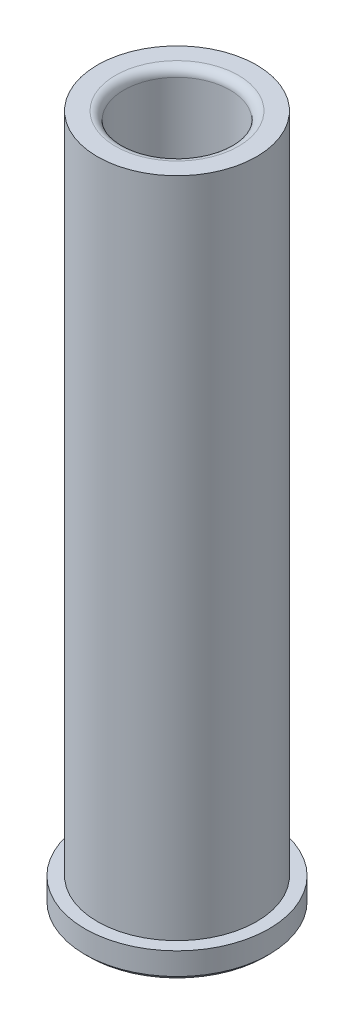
ISO-10303-21;
HEADER;
FILE_DESCRIPTION(('STEP AP214'),'2;1');
FILE_NAME('part.step','',(''),(''),'','','');
FILE_SCHEMA(('AUTOMOTIVE_DESIGN { 1 0 10303 214 1 1 1 1 }'));
ENDSEC;
DATA;
#1=APPLICATION_CONTEXT('core data for automotive mechanical design processes');
#2=APPLICATION_PROTOCOL_DEFINITION('international standard','automotive_design',2000,#1);
#3=PRODUCT_CONTEXT('',#1,'mechanical');
#4=PRODUCT('Part','Part','',(#3));
#5=PRODUCT_RELATED_PRODUCT_CATEGORY('part','',(#4));
#6=PRODUCT_DEFINITION_FORMATION('','',#4);
#7=PRODUCT_DEFINITION_CONTEXT('part definition',#1,'design');
#8=PRODUCT_DEFINITION('design','',#6,#7);
#9=PRODUCT_DEFINITION_SHAPE('','',#8);
#10=(LENGTH_UNIT() NAMED_UNIT(*) SI_UNIT(.MILLI.,.METRE.));
#11=(NAMED_UNIT(*) PLANE_ANGLE_UNIT() SI_UNIT($,.RADIAN.));
#12=(NAMED_UNIT(*) SI_UNIT($,.STERADIAN.) SOLID_ANGLE_UNIT());
#13=UNCERTAINTY_MEASURE_WITH_UNIT(LENGTH_MEASURE(1.E-05),#10,'distance_accuracy_value','');
#14=(GEOMETRIC_REPRESENTATION_CONTEXT(3) GLOBAL_UNCERTAINTY_ASSIGNED_CONTEXT((#13)) GLOBAL_UNIT_ASSIGNED_CONTEXT((#10,
#11,#12)) REPRESENTATION_CONTEXT('',''));
#15=CARTESIAN_POINT('',(0.,0.,0.));
#16=DIRECTION('',(0.,0.,1.));
#17=DIRECTION('',(1.,0.,0.));
#18=AXIS2_PLACEMENT_3D('',#15,#16,#17);
#19=CARTESIAN_POINT('',(3.49148336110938E-12,-1000.,0.));
#20=DIRECTION('',(0.,-1.,0.));
#21=DIRECTION('',(1.,0.,0.));
#22=AXIS2_PLACEMENT_3D('',#19,#20,#21);
#23=CYLINDRICAL_SURFACE('',#22,14.2938499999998);
#24=CARTESIAN_POINT('',(0.,4.7625,0.));
#25=DIRECTION('',(0.,-1.,0.));
#26=DIRECTION('',(1.,0.,0.));
#27=AXIS2_PLACEMENT_3D('',#24,#25,#26);
#28=CIRCLE('',#27,14.29385);
#29=CARTESIAN_POINT('',(14.29385,4.76250000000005,0.));
#30=VERTEX_POINT('',#29);
#31=EDGE_CURVE('E60',#30,#30,#28,.T.);
#32=ORIENTED_EDGE('',*,*,#31,.F.);
#33=EDGE_LOOP('',(#32));
#34=FACE_BOUND('',#33,.T.);
#35=CARTESIAN_POINT('',(-4.3233292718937E-13,123.825,0.));
#36=DIRECTION('',(0.,-1.,0.));
#37=DIRECTION('',(1.,0.,0.));
#38=AXIS2_PLACEMENT_3D('',#35,#36,#37);
#39=CIRCLE('',#38,14.2938499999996);
#40=CARTESIAN_POINT('',(14.2938499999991,123.825,0.));
#41=VERTEX_POINT('',#40);
#42=EDGE_CURVE('E39',#41,#41,#39,.T.);
#43=ORIENTED_EDGE('',*,*,#42,.T.);
#44=EDGE_LOOP('',(#43));
#45=FACE_BOUND('',#44,.T.);
#46=ADVANCED_FACE('F28',(#34,#45),#23,.T.);
#47=CARTESIAN_POINT('',(-14.29385,123.825,0.));
#48=DIRECTION('',(0.,-1.,0.));
#49=DIRECTION('',(1.,0.,0.));
#50=AXIS2_PLACEMENT_3D('',#47,#48,#49);
#51=PLANE('',#50);
#52=CARTESIAN_POINT('',(-4.32332927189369E-13,123.825,0.));
#53=DIRECTION('',(0.,-1.,0.));
#54=DIRECTION('',(1.,0.,0.));
#55=AXIS2_PLACEMENT_3D('',#52,#53,#54);
#56=CIRCLE('',#55,11.0553499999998);
#57=CARTESIAN_POINT('',(11.0553499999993,123.825,0.));
#58=VERTEX_POINT('',#57);
#59=EDGE_CURVE('E35',#58,#58,#56,.T.);
#60=ORIENTED_EDGE('',*,*,#59,.T.);
#61=EDGE_LOOP('',(#60));
#62=FACE_BOUND('',#61,.T.);
#63=ORIENTED_EDGE('',*,*,#42,.F.);
#64=EDGE_LOOP('',(#63));
#65=FACE_BOUND('',#64,.T.);
#66=ADVANCED_FACE('F68',(#62,#65),#51,.F.);
#67=CARTESIAN_POINT('',(3.49148336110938E-12,-1000.,0.));
#68=DIRECTION('',(0.,-1.,0.));
#69=DIRECTION('',(1.,0.,0.));
#70=AXIS2_PLACEMENT_3D('',#67,#68,#69);
#71=CYLINDRICAL_SURFACE('',#70,9.53134999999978);
#72=CARTESIAN_POINT('',(-4.27011906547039E-13,122.301,0.));
#73=DIRECTION('',(0.,-1.,0.));
#74=DIRECTION('',(1.,0.,0.));
#75=AXIS2_PLACEMENT_3D('',#72,#73,#74);
#76=CIRCLE('',#75,9.53134999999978);
#77=CARTESIAN_POINT('',(9.53134999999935,122.301,0.));
#78=VERTEX_POINT('',#77);
#79=EDGE_CURVE('E10',#78,#78,#76,.F.);
#80=ORIENTED_EDGE('',*,*,#79,.T.);
#81=EDGE_LOOP('',(#80));
#82=FACE_BOUND('',#81,.T.);
#83=CARTESIAN_POINT('',(0.,0.761999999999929,0.));
#84=DIRECTION('',(0.,-1.,0.));
#85=DIRECTION('',(1.,0.,0.));
#86=AXIS2_PLACEMENT_3D('',#83,#84,#85);
#87=CIRCLE('',#86,9.53134999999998);
#88=CARTESIAN_POINT('',(9.53134999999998,0.761999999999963,0.));
#89=VERTEX_POINT('',#88);
#90=EDGE_CURVE('E43',#89,#89,#87,.T.);
#91=ORIENTED_EDGE('',*,*,#90,.T.);
#92=EDGE_LOOP('',(#91));
#93=FACE_BOUND('',#92,.T.);
#94=ADVANCED_FACE('F72',(#82,#93),#71,.F.);
#95=CARTESIAN_POINT('',(0.,0.,0.));
#96=DIRECTION('',(0.,-1.,0.));
#97=DIRECTION('',(1.,0.,0.));
#98=AXIS2_PLACEMENT_3D('',#95,#96,#97);
#99=CONICAL_SURFACE('',#98,10.29335,0.785398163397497);
#100=ORIENTED_EDGE('',*,*,#90,.F.);
#101=EDGE_LOOP('',(#100));
#102=FACE_BOUND('',#101,.T.);
#103=CARTESIAN_POINT('',(0.,0.,0.));
#104=DIRECTION('',(0.,-1.,0.));
#105=DIRECTION('',(1.,0.,0.));
#106=AXIS2_PLACEMENT_3D('',#103,#104,#105);
#107=CIRCLE('',#106,10.29335);
#108=CARTESIAN_POINT('',(10.29335,0.,0.));
#109=VERTEX_POINT('',#108);
#110=EDGE_CURVE('E48',#109,#109,#107,.T.);
#111=ORIENTED_EDGE('',*,*,#110,.T.);
#112=EDGE_LOOP('',(#111));
#113=FACE_BOUND('',#112,.T.);
#114=ADVANCED_FACE('F77',(#102,#113),#99,.F.);
#115=CARTESIAN_POINT('',(-10.29335,0.,0.));
#116=DIRECTION('',(0.,1.,0.));
#117=DIRECTION('',(-1.,0.,0.));
#118=AXIS2_PLACEMENT_3D('',#115,#116,#117);
#119=PLANE('',#118);
#120=ORIENTED_EDGE('',*,*,#110,.F.);
#121=EDGE_LOOP('',(#120));
#122=FACE_BOUND('',#121,.T.);
#123=CARTESIAN_POINT('',(0.,0.,0.));
#124=DIRECTION('',(0.,-1.,0.));
#125=DIRECTION('',(1.,0.,0.));
#126=AXIS2_PLACEMENT_3D('',#123,#124,#125);
#127=CIRCLE('',#126,15.7734);
#128=CARTESIAN_POINT('',(15.7734,0.,0.));
#129=VERTEX_POINT('',#128);
#130=EDGE_CURVE('E51',#129,#129,#127,.T.);
#131=ORIENTED_EDGE('',*,*,#130,.T.);
#132=EDGE_LOOP('',(#131));
#133=FACE_BOUND('',#132,.T.);
#134=ADVANCED_FACE('F82',(#122,#133),#119,.F.);
#135=CARTESIAN_POINT('',(0.,0.761999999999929,0.));
#136=DIRECTION('',(0.,1.,0.));
#137=DIRECTION('',(-1.,0.,0.));
#138=AXIS2_PLACEMENT_3D('',#135,#136,#137);
#139=CONICAL_SURFACE('',#138,16.5354,0.785398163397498);
#140=ORIENTED_EDGE('',*,*,#130,.F.);
#141=EDGE_LOOP('',(#140));
#142=FACE_BOUND('',#141,.T.);
#143=CARTESIAN_POINT('',(0.,0.761999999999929,0.));
#144=DIRECTION('',(0.,-1.,0.));
#145=DIRECTION('',(1.,0.,0.));
#146=AXIS2_PLACEMENT_3D('',#143,#144,#145);
#147=CIRCLE('',#146,16.5354);
#148=CARTESIAN_POINT('',(16.5354,0.761999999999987,0.));
#149=VERTEX_POINT('',#148);
#150=EDGE_CURVE('E54',#149,#149,#147,.T.);
#151=ORIENTED_EDGE('',*,*,#150,.T.);
#152=EDGE_LOOP('',(#151));
#153=FACE_BOUND('',#152,.T.);
#154=ADVANCED_FACE('F86',(#142,#153),#139,.T.);
#155=CARTESIAN_POINT('',(3.49148336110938E-12,-1000.,0.));
#156=DIRECTION('',(0.,-1.,0.));
#157=DIRECTION('',(1.,0.,0.));
#158=AXIS2_PLACEMENT_3D('',#155,#156,#157);
#159=CYLINDRICAL_SURFACE('',#158,16.5354);
#160=ORIENTED_EDGE('',*,*,#150,.F.);
#161=EDGE_LOOP('',(#160));
#162=FACE_BOUND('',#161,.T.);
#163=CARTESIAN_POINT('',(0.,4.7625,0.));
#164=DIRECTION('',(0.,-1.,0.));
#165=DIRECTION('',(1.,0.,0.));
#166=AXIS2_PLACEMENT_3D('',#163,#164,#165);
#167=CIRCLE('',#166,16.5354);
#168=CARTESIAN_POINT('',(16.5354,4.76250000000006,0.));
#169=VERTEX_POINT('',#168);
#170=EDGE_CURVE('E57',#169,#169,#167,.T.);
#171=ORIENTED_EDGE('',*,*,#170,.T.);
#172=EDGE_LOOP('',(#171));
#173=FACE_BOUND('',#172,.T.);
#174=ADVANCED_FACE('F90',(#162,#173),#159,.T.);
#175=CARTESIAN_POINT('',(-16.5354,4.76249999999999,0.));
#176=DIRECTION('',(0.,-1.,0.));
#177=DIRECTION('',(1.,0.,0.));
#178=AXIS2_PLACEMENT_3D('',#175,#176,#177);
#179=PLANE('',#178);
#180=ORIENTED_EDGE('',*,*,#170,.F.);
#181=EDGE_LOOP('',(#180));
#182=FACE_BOUND('',#181,.T.);
#183=ORIENTED_EDGE('',*,*,#31,.T.);
#184=EDGE_LOOP('',(#183));
#185=FACE_BOUND('',#184,.T.);
#186=ADVANCED_FACE('F64',(#182,#185),#179,.F.);
#187=CARTESIAN_POINT('',(-4.27011906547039E-13,122.301,0.));
#188=DIRECTION('',(0.,-1.,0.));
#189=DIRECTION('',(1.,0.,0.));
#190=AXIS2_PLACEMENT_3D('',#187,#188,#189);
#191=TOROIDAL_SURFACE('',#190,11.0553499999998,1.524);
#192=ORIENTED_EDGE('',*,*,#79,.F.);
#193=EDGE_LOOP('',(#192));
#194=FACE_BOUND('',#193,.T.);
#195=ORIENTED_EDGE('',*,*,#59,.F.);
#196=EDGE_LOOP('',(#195));
#197=FACE_BOUND('',#196,.T.);
#198=ADVANCED_FACE('F30',(#194,#197),#191,.T.);
#199=CLOSED_SHELL('',(#46,#66,#94,#114,#134,#154,#174,#186,#198));
#200=MANIFOLD_SOLID_BREP('B2',#199);
#201=ADVANCED_BREP_SHAPE_REPRESENTATION('',(#18,#200),#14);
#202=SHAPE_DEFINITION_REPRESENTATION(#9,#201);
ENDSEC;
END-ISO-10303-21;
